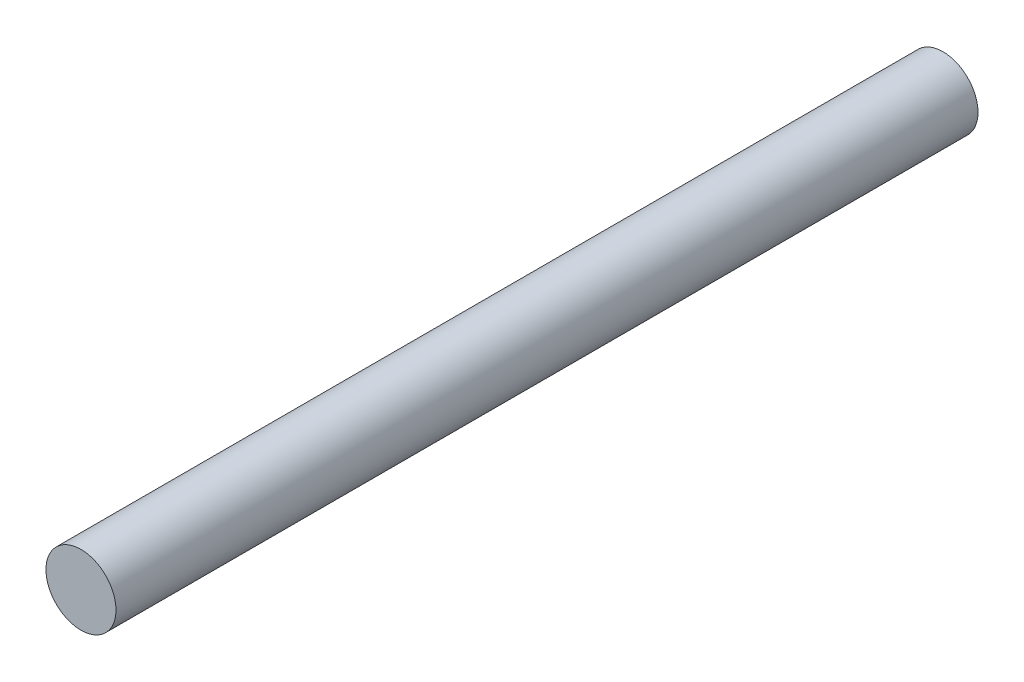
ISO-10303-21;
HEADER;
FILE_DESCRIPTION(('STEP AP214'),'2;1');
FILE_NAME('part.step','',(''),(''),'','','');
FILE_SCHEMA(('AUTOMOTIVE_DESIGN { 1 0 10303 214 1 1 1 1 }'));
ENDSEC;
DATA;
#1=APPLICATION_CONTEXT('core data for automotive mechanical design processes');
#2=APPLICATION_PROTOCOL_DEFINITION('international standard','automotive_design',2000,#1);
#3=PRODUCT_CONTEXT('',#1,'mechanical');
#4=PRODUCT('Part','Part','',(#3));
#5=PRODUCT_RELATED_PRODUCT_CATEGORY('part','',(#4));
#6=PRODUCT_DEFINITION_FORMATION('','',#4);
#7=PRODUCT_DEFINITION_CONTEXT('part definition',#1,'design');
#8=PRODUCT_DEFINITION('design','',#6,#7);
#9=PRODUCT_DEFINITION_SHAPE('','',#8);
#10=(LENGTH_UNIT() NAMED_UNIT(*) SI_UNIT(.MILLI.,.METRE.));
#11=(NAMED_UNIT(*) PLANE_ANGLE_UNIT() SI_UNIT($,.RADIAN.));
#12=(NAMED_UNIT(*) SI_UNIT($,.STERADIAN.) SOLID_ANGLE_UNIT());
#13=UNCERTAINTY_MEASURE_WITH_UNIT(LENGTH_MEASURE(1.E-05),#10,'distance_accuracy_value','');
#14=(GEOMETRIC_REPRESENTATION_CONTEXT(3) GLOBAL_UNCERTAINTY_ASSIGNED_CONTEXT((#13)) GLOBAL_UNIT_ASSIGNED_CONTEXT((#10,
#11,#12)) REPRESENTATION_CONTEXT('',''));
#15=CARTESIAN_POINT('',(0.,0.,0.));
#16=DIRECTION('',(0.,0.,1.));
#17=DIRECTION('',(1.,0.,0.));
#18=AXIS2_PLACEMENT_3D('',#15,#16,#17);
#19=CARTESIAN_POINT('',(-9.65494701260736,2.30771971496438,80.));
#20=DIRECTION('',(0.,0.,-1.));
#21=DIRECTION('',(-1.,0.,0.));
#22=AXIS2_PLACEMENT_3D('',#19,#20,#21);
#23=CYLINDRICAL_SURFACE('',#22,3.25);
#24=CARTESIAN_POINT('',(-9.65494701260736,2.30771971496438,80.));
#25=DIRECTION('',(0.,0.,1.));
#26=DIRECTION('',(1.,0.,0.));
#27=AXIS2_PLACEMENT_3D('',#24,#25,#26);
#28=CIRCLE('',#27,3.25);
#29=CARTESIAN_POINT('',(-6.40494701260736,2.30771971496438,80.));
#30=VERTEX_POINT('',#29);
#31=EDGE_CURVE('E10',#30,#30,#28,.T.);
#32=ORIENTED_EDGE('',*,*,#31,.F.);
#33=EDGE_LOOP('',(#32));
#34=FACE_BOUND('',#33,.T.);
#35=CARTESIAN_POINT('',(-9.65494701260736,2.30771971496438,0.));
#36=DIRECTION('',(0.,0.,1.));
#37=DIRECTION('',(1.,0.,0.));
#38=AXIS2_PLACEMENT_3D('',#35,#36,#37);
#39=CIRCLE('',#38,3.25);
#40=CARTESIAN_POINT('',(-6.40494701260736,2.30771971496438,0.));
#41=VERTEX_POINT('',#40);
#42=EDGE_CURVE('E32',#41,#41,#39,.T.);
#43=ORIENTED_EDGE('',*,*,#42,.T.);
#44=EDGE_LOOP('',(#43));
#45=FACE_BOUND('',#44,.T.);
#46=ADVANCED_FACE('F29',(#34,#45),#23,.T.);
#47=CARTESIAN_POINT('',(-9.65494701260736,2.30771971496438,80.));
#48=DIRECTION('',(0.,0.,1.));
#49=DIRECTION('',(1.,0.,0.));
#50=AXIS2_PLACEMENT_3D('',#47,#48,#49);
#51=PLANE('',#50);
#52=ORIENTED_EDGE('',*,*,#31,.T.);
#53=EDGE_LOOP('',(#52));
#54=FACE_BOUND('',#53,.T.);
#55=ADVANCED_FACE('F44',(#54),#51,.T.);
#56=CARTESIAN_POINT('',(-9.65494701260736,2.30771971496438,0.));
#57=DIRECTION('',(0.,0.,1.));
#58=DIRECTION('',(1.,0.,0.));
#59=AXIS2_PLACEMENT_3D('',#56,#57,#58);
#60=PLANE('',#59);
#61=ORIENTED_EDGE('',*,*,#42,.F.);
#62=EDGE_LOOP('',(#61));
#63=FACE_BOUND('',#62,.T.);
#64=ADVANCED_FACE('F42',(#63),#60,.F.);
#65=CLOSED_SHELL('',(#46,#55,#64));
#66=MANIFOLD_SOLID_BREP('B2',#65);
#67=ADVANCED_BREP_SHAPE_REPRESENTATION('',(#18,#66),#14);
#68=SHAPE_DEFINITION_REPRESENTATION(#9,#67);
ENDSEC;
END-ISO-10303-21;
